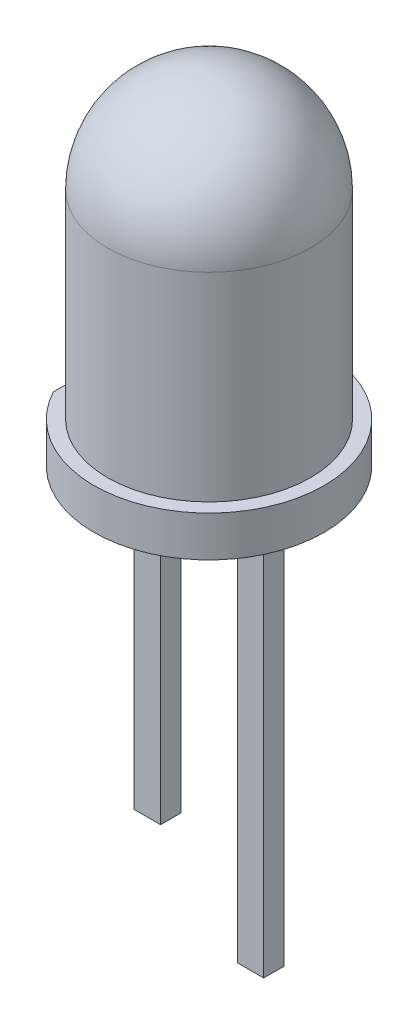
from build123d import *

# Parameters (mm, degrees)
ESQUISSE2_W             = 1.299065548
ESQUISSE2_H             = 1
ENL_V_MAT_EXTRU_1_DEPTH = 5
ESQUISSE3_W             = 0.65
ESQUISSE3_H             = 0.5
EXTRUSION1_DEPTH        = 10
EXTRUSION3_DEPTH        = 0.25
EXTRUSION3_2_DEPTH      = 0.25
ESQUISSE6_W             = 2.007351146
ESQUISSE6_H             = 2
ENL_V_MAT_EXTRU_2_DEPTH = 11.842252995


with BuildPart() as part:
    # Esquisse1 → R_volution1 (revolve)
    with BuildSketch(Plane.XY, mode=Mode.PRIVATE) as r_volution1_sk:
        with BuildLine():
            Line((-2.5, 5.9), (-2.5, 1))
            Line((-2.5, 1), (-2.835, 1))
            Line((-2.835, 1), (-2.835, 0))
            Line((-2.835, 0), (0, 0))
            Line((0, 0), (0, 8.4))
            ThreePointArc((0, 8.4), (-1.767766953, 7.667766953), (-2.5, 5.9))
        make_face()
    revolve(r_volution1_sk.sketch.rotate(Axis((0, 0, 0), (0, 1, 0)), 270), axis=Axis((0, 0, 0), (0, 1, 0)))

    # Esquisse2 → Enl_v. mat.-Extru.1 (cut, symmetric)
    with BuildSketch(Plane.XY):
        with Locations((-3.149532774, 0.5)):
            Rectangle(ESQUISSE2_W, ESQUISSE2_H)
    extrude(amount=ENL_V_MAT_EXTRU_1_DEPTH, both=True, mode=Mode.SUBTRACT)

    # Esquisse3 → Extrusion1 (add)
    with BuildSketch(Plane.XZ):
        with Locations((1.27, 0)):
            Rectangle(ESQUISSE3_W, ESQUISSE3_H)
        with Locations((-1.27, 0)):
            Rectangle(ESQUISSE3_W, ESQUISSE3_H)
    extrude(amount=EXTRUSION1_DEPTH)

    # Esquisse6 → Enl_v. mat.-Extru.2 (cut, through all)
    with BuildSketch(Plane.XY.offset(0.25)):
        with Locations((-1.948675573, -9)):
            Rectangle(ESQUISSE6_W, ESQUISSE6_H)
    extrude(amount=-ENL_V_MAT_EXTRU_2_DEPTH, mode=Mode.SUBTRACT)


with BuildPart() as body_2:
    # Esquisse5 → Extrusion3 (new, symmetric)
    with BuildSketch(Plane.XY):
        with BuildLine():
            Line((0.945, 0), (0.945, 0.23))
            Line((0.945, 0.23), (0.231099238, 0.377841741))
            Line((0.231099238, 0.377841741), (-1.292983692, 3.587552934))
            Line((-1.292983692, 3.587552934), (-0.103725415, 2.981595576))
            ThreePointArc((-0.103725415, 2.981595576), (0.234894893, 2.939718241), (0.521534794, 3.124799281))
            Line((0.521534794, 3.124799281), (0.80632764, 3.5))
            Line((0.80632764, 3.5), (1.595, 3.5))
            Line((1.595, 3.5), (1.595, 0))
            Line((1.595, 0), (0.945, 0))
        make_face()
    extrude(amount=EXTRUSION3_DEPTH, both=True)


with BuildPart() as body_3:
    # Esquisse5 → Extrusion3 2 (new, symmetric)
    with BuildSketch(Plane.XY):
        Polygon((-1.595, 0), (-1.595, 3.293272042), (-0.323998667, 0.616549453), (-0.945, 0.271653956), (-0.945, 0), align=None)
    extrude(amount=EXTRUSION3_2_DEPTH, both=True)


solid = Compound([part.part, body_2.part, body_3.part])
